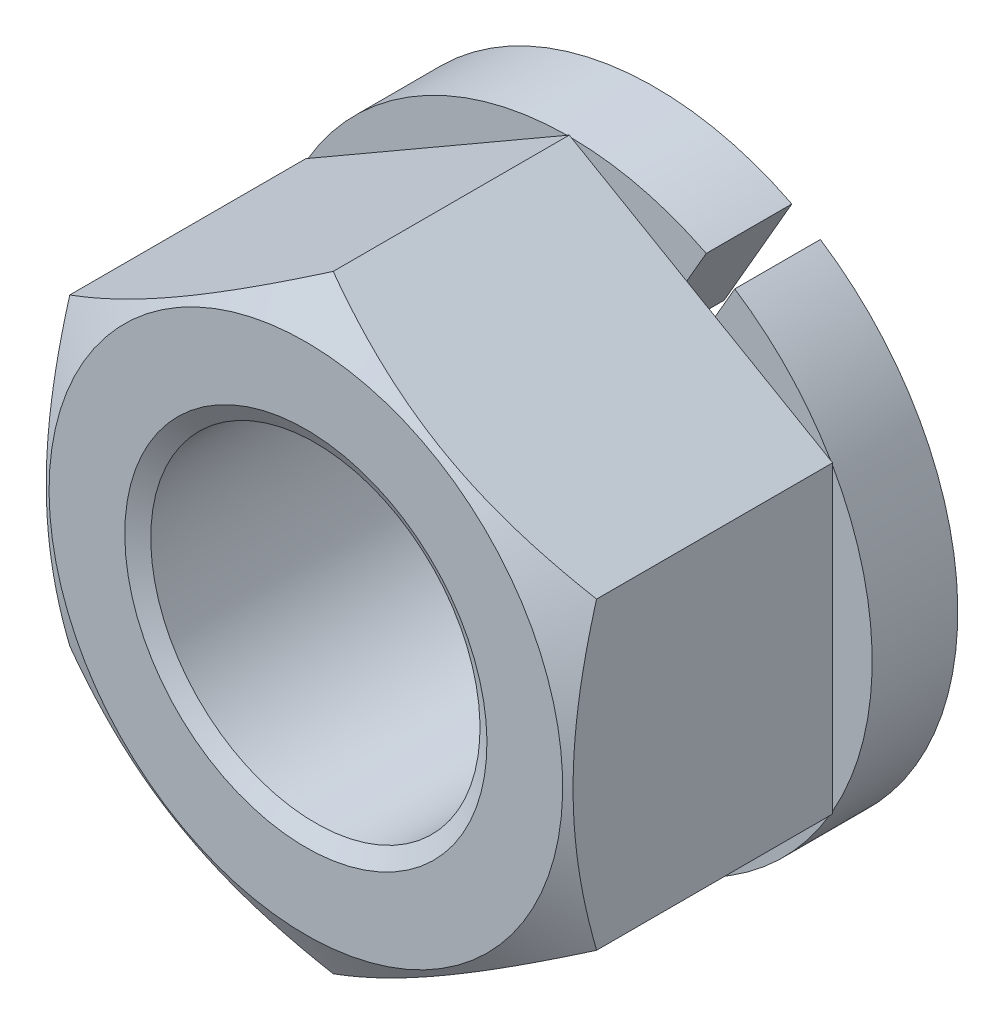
ISO-10303-21;
HEADER;
FILE_DESCRIPTION(('STEP AP214'),'2;1');
FILE_NAME('part.step','',(''),(''),'','','');
FILE_SCHEMA(('AUTOMOTIVE_DESIGN { 1 0 10303 214 1 1 1 1 }'));
ENDSEC;
DATA;
#1=APPLICATION_CONTEXT('core data for automotive mechanical design processes');
#2=APPLICATION_PROTOCOL_DEFINITION('international standard','automotive_design',2000,#1);
#3=PRODUCT_CONTEXT('',#1,'mechanical');
#4=PRODUCT('Part','Part','',(#3));
#5=PRODUCT_RELATED_PRODUCT_CATEGORY('part','',(#4));
#6=PRODUCT_DEFINITION_FORMATION('','',#4);
#7=PRODUCT_DEFINITION_CONTEXT('part definition',#1,'design');
#8=PRODUCT_DEFINITION('design','',#6,#7);
#9=PRODUCT_DEFINITION_SHAPE('','',#8);
#10=(LENGTH_UNIT() NAMED_UNIT(*) SI_UNIT(.MILLI.,.METRE.));
#11=(NAMED_UNIT(*) PLANE_ANGLE_UNIT() SI_UNIT($,.RADIAN.));
#12=(NAMED_UNIT(*) SI_UNIT($,.STERADIAN.) SOLID_ANGLE_UNIT());
#13=UNCERTAINTY_MEASURE_WITH_UNIT(LENGTH_MEASURE(1.E-05),#10,'distance_accuracy_value','');
#14=(GEOMETRIC_REPRESENTATION_CONTEXT(3) GLOBAL_UNCERTAINTY_ASSIGNED_CONTEXT((#13)) GLOBAL_UNIT_ASSIGNED_CONTEXT((#10,
#11,#12)) REPRESENTATION_CONTEXT('',''));
#15=CARTESIAN_POINT('',(0.,0.,0.));
#16=DIRECTION('',(0.,0.,1.));
#17=DIRECTION('',(1.,0.,0.));
#18=AXIS2_PLACEMENT_3D('',#15,#16,#17);
#19=CARTESIAN_POINT('',(8.,0.,1.3));
#20=DIRECTION('',(0.,0.,1.));
#21=DIRECTION('',(-0.866025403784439,0.5,0.));
#22=AXIS2_PLACEMENT_3D('',#19,#20,#21);
#23=PLANE('',#22);
#24=CARTESIAN_POINT('',(0.,0.,1.3));
#25=DIRECTION('',(0.,0.,-1.));
#26=DIRECTION('',(-0.866025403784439,0.5,0.));
#27=AXIS2_PLACEMENT_3D('',#24,#25,#26);
#28=CIRCLE('',#27,4.6);
#29=CARTESIAN_POINT('',(3.96723155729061,2.32831994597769,1.3));
#30=VERTEX_POINT('',#29);
#31=CARTESIAN_POINT('',(4.,2.2715633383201,1.3));
#32=VERTEX_POINT('',#31);
#33=EDGE_CURVE('E9',#30,#32,#28,.T.);
#34=ORIENTED_EDGE('',*,*,#33,.F.);
#35=DIRECTION('',(-0.866025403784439,0.5,0.));
#36=VECTOR('',#35,1.);
#37=CARTESIAN_POINT('',(4.,2.3094010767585,1.3));
#38=LINE('',#37,#36);
#39=CARTESIAN_POINT('',(4.,2.3094010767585,1.3));
#40=VERTEX_POINT('',#39);
#41=EDGE_CURVE('E344',#40,#30,#38,.T.);
#42=ORIENTED_EDGE('',*,*,#41,.F.);
#43=DIRECTION('',(0.,1.,0.));
#44=VECTOR('',#43,1.);
#45=CARTESIAN_POINT('',(4.,-2.30940107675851,1.3));
#46=LINE('',#45,#44);
#47=EDGE_CURVE('E339',#32,#40,#46,.T.);
#48=ORIENTED_EDGE('',*,*,#47,.F.);
#49=EDGE_LOOP('',(#34,#42,#48));
#50=FACE_BOUND('',#49,.T.);
#51=ADVANCED_FACE('F14',(#50),#23,.F.);
#52=CARTESIAN_POINT('',(4.,-2.27156333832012,1.3));
#53=VERTEX_POINT('',#52);
#54=CARTESIAN_POINT('',(3.9672315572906,-2.3283199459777,1.3));
#55=VERTEX_POINT('',#54);
#56=EDGE_CURVE('E24',#53,#55,#28,.T.);
#57=ORIENTED_EDGE('',*,*,#56,.F.);
#58=CARTESIAN_POINT('',(4.,-2.30940107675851,1.3));
#59=VERTEX_POINT('',#58);
#60=EDGE_CURVE('E341',#59,#53,#46,.T.);
#61=ORIENTED_EDGE('',*,*,#60,.F.);
#62=DIRECTION('',(0.866025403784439,0.5,0.));
#63=VECTOR('',#62,1.);
#64=CARTESIAN_POINT('',(0.,-4.61880215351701,1.3));
#65=LINE('',#64,#63);
#66=EDGE_CURVE('E333',#55,#59,#65,.T.);
#67=ORIENTED_EDGE('',*,*,#66,.F.);
#68=EDGE_LOOP('',(#57,#61,#67));
#69=FACE_BOUND('',#68,.T.);
#70=ADVANCED_FACE('F291',(#69),#23,.F.);
#71=CARTESIAN_POINT('',(0.0327684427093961,-4.59988328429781,1.3));
#72=VERTEX_POINT('',#71);
#73=CARTESIAN_POINT('',(-0.0327684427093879,-4.59988328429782,1.3));
#74=VERTEX_POINT('',#73);
#75=EDGE_CURVE('E434',#72,#74,#28,.T.);
#76=ORIENTED_EDGE('',*,*,#75,.F.);
#77=CARTESIAN_POINT('',(0.,-4.61880215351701,1.3));
#78=VERTEX_POINT('',#77);
#79=EDGE_CURVE('E336',#78,#72,#65,.T.);
#80=ORIENTED_EDGE('',*,*,#79,.F.);
#81=DIRECTION('',(0.866025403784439,-0.5,0.));
#82=VECTOR('',#81,1.);
#83=CARTESIAN_POINT('',(-4.,-2.30940107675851,1.3));
#84=LINE('',#83,#82);
#85=EDGE_CURVE('E357',#74,#78,#84,.T.);
#86=ORIENTED_EDGE('',*,*,#85,.F.);
#87=EDGE_LOOP('',(#76,#80,#86));
#88=FACE_BOUND('',#87,.T.);
#89=ADVANCED_FACE('F418',(#88),#23,.F.);
#90=CARTESIAN_POINT('',(-3.96723155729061,-2.32831994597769,1.3));
#91=VERTEX_POINT('',#90);
#92=CARTESIAN_POINT('',(-4.,-2.27156333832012,1.3));
#93=VERTEX_POINT('',#92);
#94=EDGE_CURVE('E438',#91,#93,#28,.T.);
#95=ORIENTED_EDGE('',*,*,#94,.F.);
#96=CARTESIAN_POINT('',(-4.,-2.30940107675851,1.3));
#97=VERTEX_POINT('',#96);
#98=EDGE_CURVE('E359',#97,#91,#84,.T.);
#99=ORIENTED_EDGE('',*,*,#98,.F.);
#100=DIRECTION('',(0.,-1.,0.));
#101=VECTOR('',#100,1.);
#102=CARTESIAN_POINT('',(-4.,2.3094010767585,1.3));
#103=LINE('',#102,#101);
#104=EDGE_CURVE('E352',#93,#97,#103,.T.);
#105=ORIENTED_EDGE('',*,*,#104,.F.);
#106=EDGE_LOOP('',(#95,#99,#105));
#107=FACE_BOUND('',#106,.T.);
#108=ADVANCED_FACE('F423',(#107),#23,.F.);
#109=CARTESIAN_POINT('',(-4.,2.27156333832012,1.3));
#110=VERTEX_POINT('',#109);
#111=CARTESIAN_POINT('',(-3.96723155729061,2.32831994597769,1.3));
#112=VERTEX_POINT('',#111);
#113=EDGE_CURVE('E450',#110,#112,#28,.T.);
#114=ORIENTED_EDGE('',*,*,#113,.F.);
#115=CARTESIAN_POINT('',(-4.,2.3094010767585,1.3));
#116=VERTEX_POINT('',#115);
#117=EDGE_CURVE('E354',#116,#110,#103,.T.);
#118=ORIENTED_EDGE('',*,*,#117,.F.);
#119=DIRECTION('',(-0.866025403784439,-0.5,0.));
#120=VECTOR('',#119,1.);
#121=CARTESIAN_POINT('',(0.,4.61880215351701,1.3));
#122=LINE('',#121,#120);
#123=EDGE_CURVE('E347',#112,#116,#122,.T.);
#124=ORIENTED_EDGE('',*,*,#123,.F.);
#125=EDGE_LOOP('',(#114,#118,#124));
#126=FACE_BOUND('',#125,.T.);
#127=ADVANCED_FACE('F429',(#126),#23,.F.);
#128=CARTESIAN_POINT('',(-0.0327684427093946,4.59988328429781,1.3));
#129=VERTEX_POINT('',#128);
#130=CARTESIAN_POINT('',(0.0327684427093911,4.59988328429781,1.3));
#131=VERTEX_POINT('',#130);
#132=EDGE_CURVE('E152',#129,#131,#28,.T.);
#133=ORIENTED_EDGE('',*,*,#132,.F.);
#134=CARTESIAN_POINT('',(0.,4.61880215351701,1.3));
#135=VERTEX_POINT('',#134);
#136=EDGE_CURVE('E349',#135,#129,#122,.T.);
#137=ORIENTED_EDGE('',*,*,#136,.F.);
#138=EDGE_CURVE('E343',#131,#135,#38,.T.);
#139=ORIENTED_EDGE('',*,*,#138,.F.);
#140=EDGE_LOOP('',(#133,#137,#139));
#141=FACE_BOUND('',#140,.T.);
#142=ADVANCED_FACE('F458',(#141),#23,.F.);
#143=DIRECTION('',(0.5,0.866025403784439,0.));
#144=VECTOR('',#143,1.);
#145=CARTESIAN_POINT('',(1.48536410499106,2.07272609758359,1.3));
#146=LINE('',#145,#144);
#147=CARTESIAN_POINT('',(1.58581274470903,2.24670824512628,1.3));
#148=VERTEX_POINT('',#147);
#149=CARTESIAN_POINT('',(2.21650635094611,3.33910161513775,1.3));
#150=VERTEX_POINT('',#149);
#151=EDGE_CURVE('E317',#148,#150,#146,.T.);
#152=ORIENTED_EDGE('',*,*,#151,.F.);
#153=CARTESIAN_POINT('',(0.,0.,1.3));
#154=DIRECTION('',(0.,0.,1.));
#155=DIRECTION('',(-0.866025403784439,0.5,0.));
#156=AXIS2_PLACEMENT_3D('',#153,#154,#155);
#157=CIRCLE('',#156,2.75);
#158=CARTESIAN_POINT('',(1.1528000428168,2.49670824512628,1.3));
#159=VERTEX_POINT('',#158);
#160=EDGE_CURVE('E328',#148,#159,#157,.T.);
#161=ORIENTED_EDGE('',*,*,#160,.T.);
#162=DIRECTION('',(-0.5,-0.866025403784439,0.));
#163=VECTOR('',#162,1.);
#164=CARTESIAN_POINT('',(1.05235140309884,2.32272609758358,1.3));
#165=LINE('',#164,#163);
#166=CARTESIAN_POINT('',(1.78349364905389,3.58910161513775,1.3));
#167=VERTEX_POINT('',#166);
#168=EDGE_CURVE('E168',#167,#159,#165,.T.);
#169=ORIENTED_EDGE('',*,*,#168,.F.);
#170=EDGE_CURVE('E483',#150,#167,#38,.T.);
#171=ORIENTED_EDGE('',*,*,#170,.F.);
#172=EDGE_LOOP('',(#152,#161,#169,#171));
#173=FACE_BOUND('',#172,.T.);
#174=ADVANCED_FACE('F255',(#173),#23,.F.);
#175=CARTESIAN_POINT('',(0.,-4.61880215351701,5.3));
#176=DIRECTION('',(-0.5,0.866025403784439,0.));
#177=DIRECTION('',(-0.866025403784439,-0.5,0.));
#178=AXIS2_PLACEMENT_3D('',#175,#176,#177);
#179=PLANE('',#178);
#180=CARTESIAN_POINT('',(-0.000199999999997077,-4.61891762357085,4.88493271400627));
#181=CARTESIAN_POINT('',(0.175579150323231,-4.51743148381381,4.94354709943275));
#182=CARTESIAN_POINT('',(0.352875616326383,-4.41506932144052,4.99685465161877));
#183=CARTESIAN_POINT('',(0.71053859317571,-4.2085725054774,5.08990330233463));
#184=CARTESIAN_POINT('',(0.890911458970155,-4.10443418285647,5.12961148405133));
#185=CARTESIAN_POINT('',(1.2494218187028,-3.89744813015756,5.19142275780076));
#186=CARTESIAN_POINT('',(1.42750415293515,-3.7946322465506,5.21393724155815));
#187=CARTESIAN_POINT('',(1.78450671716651,-3.58851671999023,5.24081434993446));
#188=CARTESIAN_POINT('',(1.9634256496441,-3.48521782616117,5.2451992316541));
#189=CARTESIAN_POINT('',(2.29774284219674,-3.29219970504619,5.23607490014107));
#190=CARTESIAN_POINT('',(2.45319115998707,-3.20245157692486,5.22480601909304));
#191=CARTESIAN_POINT('',(2.76307505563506,-3.02354002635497,5.18909098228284));
#192=CARTESIAN_POINT('',(2.91750956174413,-2.93437722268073,5.1646326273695));
#193=CARTESIAN_POINT('',(3.22803232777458,-2.75509682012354,5.10348890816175));
#194=CARTESIAN_POINT('',(3.38408128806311,-2.6650019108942,5.06654436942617));
#195=CARTESIAN_POINT('',(3.69385183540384,-2.48615580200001,4.98269490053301));
#196=CARTESIAN_POINT('',(3.84757739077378,-2.39740231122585,4.93580967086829));
#197=CARTESIAN_POINT('',(4.0002,-2.30928560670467,4.88493271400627));
#198=B_SPLINE_CURVE_WITH_KNOTS('',3,(#180,#181,#182,#183,#184,#185,#186,#187,#188,#189,#190,
#191,#192,#193,#194,#195,#196,#197),.UNSPECIFIED.,.F.,.F.,(4,2,2,2,2,2,2,2,4),(0.,
0.634047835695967,1.26961969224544,1.88946157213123,2.50854226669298,3.04757825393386,
3.58711366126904,4.13861653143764,4.68903648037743),.UNSPECIFIED.);
#199=CARTESIAN_POINT('',(5.80481843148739E-13,-4.61880215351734,4.88499938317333));
#200=VERTEX_POINT('',#199);
#201=CARTESIAN_POINT('',(4.,-2.30940107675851,4.88499938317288));
#202=VERTEX_POINT('',#201);
#203=EDGE_CURVE('E239',#200,#202,#198,.T.);
#204=ORIENTED_EDGE('',*,*,#203,.F.);
#205=DIRECTION('',(0.,0.,-1.));
#206=VECTOR('',#205,1.);
#207=CARTESIAN_POINT('',(0.,-4.61880215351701,5.3));
#208=LINE('',#207,#206);
#209=EDGE_CURVE('E362',#200,#78,#208,.T.);
#210=ORIENTED_EDGE('',*,*,#209,.T.);
#211=ORIENTED_EDGE('',*,*,#79,.T.);
#212=EDGE_CURVE('E340',#72,#55,#65,.T.);
#213=ORIENTED_EDGE('',*,*,#212,.T.);
#214=ORIENTED_EDGE('',*,*,#66,.T.);
#215=DIRECTION('',(0.,0.,-1.));
#216=VECTOR('',#215,1.);
#217=CARTESIAN_POINT('',(4.,-2.30940107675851,5.3));
#218=LINE('',#217,#216);
#219=EDGE_CURVE('E377',#202,#59,#218,.T.);
#220=ORIENTED_EDGE('',*,*,#219,.F.);
#221=EDGE_LOOP('',(#204,#210,#211,#213,#214,#220));
#222=FACE_BOUND('',#221,.T.);
#223=ADVANCED_FACE('F16',(#222),#179,.F.);
#224=CARTESIAN_POINT('',(4.,-2.30940107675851,5.3));
#225=DIRECTION('',(-1.,0.,0.));
#226=DIRECTION('',(0.,-1.,0.));
#227=AXIS2_PLACEMENT_3D('',#224,#225,#226);
#228=PLANE('',#227);
#229=CARTESIAN_POINT('',(4.,-2.30963201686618,4.88493271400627));
#230=CARTESIAN_POINT('',(4.,-2.1066597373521,4.94354709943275));
#231=CARTESIAN_POINT('',(4.,-1.90193541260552,4.99685465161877));
#232=CARTESIAN_POINT('',(4.,-1.48894178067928,5.08990330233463));
#233=CARTESIAN_POINT('',(4.,-1.28066513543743,5.12961148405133));
#234=CARTESIAN_POINT('',(4.,-0.866693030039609,5.19142275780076));
#235=CARTESIAN_POINT('',(4.,-0.661061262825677,5.21393724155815));
#236=CARTESIAN_POINT('',(4.,-0.248830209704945,5.24081434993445));
#237=CARTESIAN_POINT('',(4.,-0.0422324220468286,5.24519923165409));
#238=CARTESIAN_POINT('',(4.,0.343803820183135,5.23607490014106));
#239=CARTESIAN_POINT('',(4.,0.523300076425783,5.22480601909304));
#240=CARTESIAN_POINT('',(4.,0.881123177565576,5.18909098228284));
#241=CARTESIAN_POINT('',(4.,1.05944878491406,5.1646326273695));
#242=CARTESIAN_POINT('',(4.,1.41800959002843,5.10348890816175));
#243=CARTESIAN_POINT('',(4.,1.59819940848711,5.06654436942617));
#244=CARTESIAN_POINT('',(4.,1.95589162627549,4.98269490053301));
#245=CARTESIAN_POINT('',(4.,2.13339860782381,4.9358096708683));
#246=CARTESIAN_POINT('',(4.,2.30963201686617,4.88493271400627));
#247=B_SPLINE_CURVE_WITH_KNOTS('',3,(#229,#230,#231,#232,#233,#234,#235,#236,#237,#238,#239,
#240,#241,#242,#243,#244,#245,#246),.UNSPECIFIED.,.F.,.F.,(4,2,2,2,2,2,2,2,4),(0.,
0.634047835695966,1.26961969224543,1.88946157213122,2.50854226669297,3.04757825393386,
3.58711366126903,4.13861653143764,4.68903648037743),.UNSPECIFIED.);
#248=CARTESIAN_POINT('',(4.00000000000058,2.30940107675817,4.88499938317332));
#249=VERTEX_POINT('',#248);
#250=EDGE_CURVE('E233',#202,#249,#247,.T.);
#251=ORIENTED_EDGE('',*,*,#250,.F.);
#252=ORIENTED_EDGE('',*,*,#219,.T.);
#253=ORIENTED_EDGE('',*,*,#60,.T.);
#254=EDGE_CURVE('E33',#53,#32,#46,.T.);
#255=ORIENTED_EDGE('',*,*,#254,.T.);
#256=ORIENTED_EDGE('',*,*,#47,.T.);
#257=DIRECTION('',(0.,0.,-1.));
#258=VECTOR('',#257,1.);
#259=CARTESIAN_POINT('',(4.,2.3094010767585,5.3));
#260=LINE('',#259,#258);
#261=EDGE_CURVE('E375',#249,#40,#260,.T.);
#262=ORIENTED_EDGE('',*,*,#261,.F.);
#263=EDGE_LOOP('',(#251,#252,#253,#255,#256,#262));
#264=FACE_BOUND('',#263,.T.);
#265=ADVANCED_FACE('F245',(#264),#228,.F.);
#266=CARTESIAN_POINT('',(4.,2.3094010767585,5.3));
#267=DIRECTION('',(-0.5,-0.866025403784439,0.));
#268=DIRECTION('',(0.866025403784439,-0.5,0.));
#269=AXIS2_PLACEMENT_3D('',#266,#267,#268);
#270=PLANE('',#269);
#271=CARTESIAN_POINT('',(7.36789177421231,0.364947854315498,3.29259666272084));
#272=CARTESIAN_POINT('',(7.2165797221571,0.452307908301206,3.37733132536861));
#273=CARTESIAN_POINT('',(7.06491974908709,0.539868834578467,3.46125183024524));
#274=CARTESIAN_POINT('',(6.76071882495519,0.715499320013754,3.62700632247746));
#275=CARTESIAN_POINT('',(6.60817773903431,0.803568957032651,3.70883997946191));
#276=CARTESIAN_POINT('',(6.30124199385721,0.980778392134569,3.87037504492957));
#277=CARTESIAN_POINT('',(6.14684176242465,1.0699214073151,3.95006238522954));
#278=CARTESIAN_POINT('',(5.83681114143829,1.2489176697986,4.10616743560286));
#279=CARTESIAN_POINT('',(5.68118081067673,1.33877088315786,4.1825853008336));
#280=CARTESIAN_POINT('',(5.3635367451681,1.52216276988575,4.33362019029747));
#281=CARTESIAN_POINT('',(5.20147584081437,1.6157286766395,4.40810566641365));
#282=CARTESIAN_POINT('',(4.87545671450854,1.80395590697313,4.55142705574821));
#283=CARTESIAN_POINT('',(4.71149828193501,1.89861735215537,4.62026233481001));
#284=CARTESIAN_POINT('',(4.38173108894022,2.08900852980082,4.75047348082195));
#285=CARTESIAN_POINT('',(4.21592684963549,2.18473565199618,4.81186446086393));
#286=CARTESIAN_POINT('',(3.88194065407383,2.37756267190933,4.92521431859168));
#287=CARTESIAN_POINT('',(3.71375946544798,2.47466212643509,4.97717616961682));
#288=CARTESIAN_POINT('',(3.37580482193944,2.66978033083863,5.06891001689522));
#289=CARTESIAN_POINT('',(3.20604429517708,2.76779161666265,5.10874434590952));
#290=CARTESIAN_POINT('',(2.86441775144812,2.96502979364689,5.17394634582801));
#291=CARTESIAN_POINT('',(2.69255194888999,3.06425656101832,5.19931547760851));
#292=CARTESIAN_POINT('',(2.34981616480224,3.2621351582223,5.23323151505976));
#293=CARTESIAN_POINT('',(2.17896261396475,3.36077750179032,5.24199435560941));
#294=CARTESIAN_POINT('',(1.83721915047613,3.55808318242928,5.24252299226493));
#295=CARTESIAN_POINT('',(1.66632923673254,3.65674652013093,5.23428817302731));
#296=CARTESIAN_POINT('',(1.376161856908,3.82427473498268,5.206455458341));
#297=CARTESIAN_POINT('',(1.25657295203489,3.89331942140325,5.19094029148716));
#298=CARTESIAN_POINT('',(1.01827795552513,4.03089910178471,5.15255337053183));
#299=CARTESIAN_POINT('',(0.89957198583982,4.09943402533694,5.12968061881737));
#300=CARTESIAN_POINT('',(0.544939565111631,4.30418114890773,5.05122936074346));
#301=CARTESIAN_POINT('',(0.310624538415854,4.43946299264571,4.98583152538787));
#302=CARTESIAN_POINT('',(-0.039897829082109,4.64183717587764,4.87249475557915));
#303=CARTESIAN_POINT('',(-0.15792090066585,4.7099778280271,4.83161840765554));
#304=CARTESIAN_POINT('',(-0.392819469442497,4.84559657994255,4.74564464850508));
#305=CARTESIAN_POINT('',(-0.509694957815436,4.91307467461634,4.70054720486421));
#306=CARTESIAN_POINT('',(-0.74233836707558,5.04739140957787,4.60685321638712));
#307=CARTESIAN_POINT('',(-0.858106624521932,5.11423024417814,4.55825777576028));
#308=CARTESIAN_POINT('',(-1.08868288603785,5.2473535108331,4.45813729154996));
#309=CARTESIAN_POINT('',(-1.20349091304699,5.31363795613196,4.40661231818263));
#310=CARTESIAN_POINT('',(-1.51946769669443,5.49606723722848,4.26091200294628));
#311=CARTESIAN_POINT('',(-1.71974743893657,5.6116988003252,4.16416822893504));
#312=CARTESIAN_POINT('',(-2.11823117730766,5.84176349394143,3.96511964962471));
#313=CARTESIAN_POINT('',(-2.31643493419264,5.95619648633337,3.86281421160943));
#314=CARTESIAN_POINT('',(-2.71125542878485,6.18414620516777,3.65400373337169));
#315=CARTESIAN_POINT('',(-2.90787158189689,6.29766259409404,3.54749722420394));
#316=CARTESIAN_POINT('',(-3.29979247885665,6.52393822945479,3.3313077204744));
#317=CARTESIAN_POINT('',(-3.49509718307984,6.63669745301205,3.22162463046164));
#318=CARTESIAN_POINT('',(-3.88495810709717,6.86178376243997,2.9996241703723));
#319=CARTESIAN_POINT('',(-4.07951267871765,6.97410989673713,2.88730294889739));
#320=CARTESIAN_POINT('',(-4.46776896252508,7.19826976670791,2.66071005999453));
#321=CARTESIAN_POINT('',(-4.66147066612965,7.3101034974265,2.54643837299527));
#322=CARTESIAN_POINT('',(-5.24145333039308,7.6449566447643,2.20135857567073));
#323=CARTESIAN_POINT('',(-5.62670044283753,7.86737916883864,1.96823479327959));
#324=CARTESIAN_POINT('',(-6.35346211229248,8.28697521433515,1.52350784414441));
#325=CARTESIAN_POINT('',(-6.69517072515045,8.48426077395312,1.31232552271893));
#326=CARTESIAN_POINT('',(-7.37750291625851,8.8782054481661,0.887578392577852));
#327=CARTESIAN_POINT('',(-7.71812642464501,9.07486452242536,0.674013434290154));
#328=CARTESIAN_POINT('',(-8.39742822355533,9.46705959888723,0.245830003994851));
#329=CARTESIAN_POINT('',(-8.73610923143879,9.66259716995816,0.0312172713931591));
#330=CARTESIAN_POINT('',(-9.41279636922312,10.0532826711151,-0.399350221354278));
#331=CARTESIAN_POINT('',(-9.75080255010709,10.2484306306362,-0.615304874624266));
#332=CARTESIAN_POINT('',(-10.0885733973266,10.4434427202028,-0.831746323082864));
#333=B_SPLINE_CURVE_WITH_KNOTS('',3,(#271,#272,#273,#274,#275,#276,#277,#278,#279,#280,#281,
#282,#283,#284,#285,#286,#287,#288,#289,#290,#291,#292,#293,#294,#295,#296,#297,#298,#299,#300,
#301,#302,#303,#304,#305,#306,#307,#308,#309,#310,#311,#312,#313,#314,#315,#316,#317,#318,#319,
#320,#321,#322,#323,#324,#325,#326,#327,#328,#329,#330,#331,#332),.UNSPECIFIED.,.F.,.F.,(4,2,2,
2,2,2,2,2,2,2,2,2,2,2,2,2,2,2,2,2,2,2,2,2,2,2,2,2,2,2,4),(0.,0.582556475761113,1.16520461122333,
1.75103140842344,2.33683037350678,2.94099294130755,3.54522322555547,4.14820552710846,
4.75099735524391,5.35063652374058,5.95021512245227,6.5419423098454,7.13369091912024,
7.55036371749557,7.9670930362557,8.8009878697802,9.22779049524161,9.65459639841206,
10.081268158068,10.5079296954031,11.259867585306,12.0118911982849,12.7641801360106,
13.5164917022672,14.2699797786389,15.0234754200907,16.5301238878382,17.8727098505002,
19.2153805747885,20.553654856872,21.891823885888),.UNSPECIFIED.);
#334=CARTESIAN_POINT('',(0.,4.61880215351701,4.88499938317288));
#335=VERTEX_POINT('',#334);
#336=EDGE_CURVE('E227',#249,#335,#333,.T.);
#337=ORIENTED_EDGE('',*,*,#336,.F.);
#338=ORIENTED_EDGE('',*,*,#261,.T.);
#339=ORIENTED_EDGE('',*,*,#41,.T.);
#340=EDGE_CURVE('E348',#30,#150,#38,.T.);
#341=ORIENTED_EDGE('',*,*,#340,.T.);
#342=ORIENTED_EDGE('',*,*,#170,.T.);
#343=EDGE_CURVE('E161',#167,#131,#38,.T.);
#344=ORIENTED_EDGE('',*,*,#343,.T.);
#345=ORIENTED_EDGE('',*,*,#138,.T.);
#346=DIRECTION('',(0.,0.,-1.));
#347=VECTOR('',#346,1.);
#348=CARTESIAN_POINT('',(0.,4.61880215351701,5.3));
#349=LINE('',#348,#347);
#350=EDGE_CURVE('E372',#335,#135,#349,.T.);
#351=ORIENTED_EDGE('',*,*,#350,.F.);
#352=EDGE_LOOP('',(#337,#338,#339,#341,#342,#344,#345,#351));
#353=FACE_BOUND('',#352,.T.);
#354=ADVANCED_FACE('F218',(#353),#270,.F.);
#355=CARTESIAN_POINT('',(0.,4.61880215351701,5.3));
#356=DIRECTION('',(0.5,-0.866025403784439,0.));
#357=DIRECTION('',(0.866025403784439,0.5,0.));
#358=AXIS2_PLACEMENT_3D('',#355,#356,#357);
#359=PLANE('',#358);
#360=CARTESIAN_POINT('',(0.00020000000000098,4.61891762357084,4.88493271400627));
#361=CARTESIAN_POINT('',(-0.17557915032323,4.5174314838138,4.94354709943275));
#362=CARTESIAN_POINT('',(-0.352875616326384,4.41506932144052,4.99685465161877));
#363=CARTESIAN_POINT('',(-0.710538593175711,4.20857250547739,5.08990330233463));
#364=CARTESIAN_POINT('',(-0.890911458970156,4.10443418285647,5.12961148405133));
#365=CARTESIAN_POINT('',(-1.2494218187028,3.89744813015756,5.19142275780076));
#366=CARTESIAN_POINT('',(-1.42750415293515,3.79463224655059,5.21393724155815));
#367=CARTESIAN_POINT('',(-1.78450671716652,3.58851671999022,5.24081434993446));
#368=CARTESIAN_POINT('',(-1.9634256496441,3.48521782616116,5.2451992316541));
#369=CARTESIAN_POINT('',(-2.29774284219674,3.29219970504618,5.23607490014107));
#370=CARTESIAN_POINT('',(-2.45319115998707,3.20245157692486,5.22480601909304));
#371=CARTESIAN_POINT('',(-2.76307505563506,3.02354002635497,5.18909098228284));
#372=CARTESIAN_POINT('',(-2.91750956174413,2.93437722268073,5.1646326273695));
#373=CARTESIAN_POINT('',(-3.22803232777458,2.75509682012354,5.10348890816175));
#374=CARTESIAN_POINT('',(-3.38408128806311,2.6650019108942,5.06654436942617));
#375=CARTESIAN_POINT('',(-3.69385183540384,2.48615580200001,4.98269490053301));
#376=CARTESIAN_POINT('',(-3.84757739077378,2.39740231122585,4.9358096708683));
#377=CARTESIAN_POINT('',(-4.0002,2.30928560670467,4.88493271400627));
#378=B_SPLINE_CURVE_WITH_KNOTS('',3,(#360,#361,#362,#363,#364,#365,#366,#367,#368,#369,#370,
#371,#372,#373,#374,#375,#376,#377),.UNSPECIFIED.,.F.,.F.,(4,2,2,2,2,2,2,2,4),(0.,
0.634047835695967,1.26961969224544,1.88946157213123,2.50854226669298,3.04757825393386,
3.58711366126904,4.13861653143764,4.68903648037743),.UNSPECIFIED.);
#379=CARTESIAN_POINT('',(-4.,2.3094010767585,4.88499938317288));
#380=VERTEX_POINT('',#379);
#381=EDGE_CURVE('E221',#335,#380,#378,.T.);
#382=ORIENTED_EDGE('',*,*,#381,.F.);
#383=ORIENTED_EDGE('',*,*,#350,.T.);
#384=ORIENTED_EDGE('',*,*,#136,.T.);
#385=EDGE_CURVE('E353',#129,#112,#122,.T.);
#386=ORIENTED_EDGE('',*,*,#385,.T.);
#387=ORIENTED_EDGE('',*,*,#123,.T.);
#388=DIRECTION('',(0.,0.,-1.));
#389=VECTOR('',#388,1.);
#390=CARTESIAN_POINT('',(-4.,2.3094010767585,5.3));
#391=LINE('',#390,#389);
#392=EDGE_CURVE('E369',#380,#116,#391,.T.);
#393=ORIENTED_EDGE('',*,*,#392,.F.);
#394=EDGE_LOOP('',(#382,#383,#384,#386,#387,#393));
#395=FACE_BOUND('',#394,.T.);
#396=ADVANCED_FACE('F213',(#395),#359,.F.);
#397=CARTESIAN_POINT('',(-4.,2.3094010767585,5.3));
#398=DIRECTION('',(1.,0.,0.));
#399=DIRECTION('',(0.,1.,0.));
#400=AXIS2_PLACEMENT_3D('',#397,#398,#399);
#401=PLANE('',#400);
#402=CARTESIAN_POINT('',(-4.,2.30963201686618,4.88493271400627));
#403=CARTESIAN_POINT('',(-4.,2.1066597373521,4.94354709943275));
#404=CARTESIAN_POINT('',(-4.,1.90193541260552,4.99685465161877));
#405=CARTESIAN_POINT('',(-4.,1.48894178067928,5.08990330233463));
#406=CARTESIAN_POINT('',(-4.,1.28066513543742,5.12961148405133));
#407=CARTESIAN_POINT('',(-4.,0.866693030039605,5.19142275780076));
#408=CARTESIAN_POINT('',(-4.,0.661061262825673,5.21393724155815));
#409=CARTESIAN_POINT('',(-4.,0.24883020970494,5.24081434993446));
#410=CARTESIAN_POINT('',(-4.,0.0422324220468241,5.2451992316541));
#411=CARTESIAN_POINT('',(-4.,-0.343803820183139,5.23607490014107));
#412=CARTESIAN_POINT('',(-4.,-0.523300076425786,5.22480601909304));
#413=CARTESIAN_POINT('',(-4.,-0.881123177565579,5.18909098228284));
#414=CARTESIAN_POINT('',(-4.,-1.05944878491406,5.1646326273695));
#415=CARTESIAN_POINT('',(-4.,-1.41800959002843,5.10348890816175));
#416=CARTESIAN_POINT('',(-4.,-1.59819940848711,5.06654436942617));
#417=CARTESIAN_POINT('',(-4.,-1.9558916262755,4.98269490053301));
#418=CARTESIAN_POINT('',(-4.,-2.13339860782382,4.9358096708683));
#419=CARTESIAN_POINT('',(-4.,-2.30963201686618,4.88493271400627));
#420=B_SPLINE_CURVE_WITH_KNOTS('',3,(#402,#403,#404,#405,#406,#407,#408,#409,#410,#411,#412,
#413,#414,#415,#416,#417,#418,#419),.UNSPECIFIED.,.F.,.F.,(4,2,2,2,2,2,2,2,4),(0.,
0.634047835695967,1.26961969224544,1.88946157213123,2.50854226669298,3.04757825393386,
3.58711366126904,4.13861653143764,4.68903648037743),.UNSPECIFIED.);
#421=CARTESIAN_POINT('',(-4.,-2.30940107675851,4.88499938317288));
#422=VERTEX_POINT('',#421);
#423=EDGE_CURVE('E191',#380,#422,#420,.T.);
#424=ORIENTED_EDGE('',*,*,#423,.F.);
#425=ORIENTED_EDGE('',*,*,#392,.T.);
#426=ORIENTED_EDGE('',*,*,#117,.T.);
#427=EDGE_CURVE('E358',#110,#93,#103,.T.);
#428=ORIENTED_EDGE('',*,*,#427,.T.);
#429=ORIENTED_EDGE('',*,*,#104,.T.);
#430=DIRECTION('',(0.,0.,-1.));
#431=VECTOR('',#430,1.);
#432=CARTESIAN_POINT('',(-4.,-2.30940107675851,5.3));
#433=LINE('',#432,#431);
#434=EDGE_CURVE('E366',#422,#97,#433,.T.);
#435=ORIENTED_EDGE('',*,*,#434,.F.);
#436=EDGE_LOOP('',(#424,#425,#426,#428,#429,#435));
#437=FACE_BOUND('',#436,.T.);
#438=ADVANCED_FACE('F207',(#437),#401,.F.);
#439=CARTESIAN_POINT('',(-4.,-2.30940107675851,5.3));
#440=DIRECTION('',(0.5,0.866025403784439,0.));
#441=DIRECTION('',(-0.866025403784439,0.5,0.));
#442=AXIS2_PLACEMENT_3D('',#439,#440,#441);
#443=PLANE('',#442);
#444=CARTESIAN_POINT('',(3.3678917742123,-6.56325537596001,3.29259666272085));
#445=CARTESIAN_POINT('',(3.21657972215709,-6.4758953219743,3.37733132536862));
#446=CARTESIAN_POINT('',(3.06491974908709,-6.38833439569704,3.46125183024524));
#447=CARTESIAN_POINT('',(2.76071882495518,-6.21270391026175,3.62700632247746));
#448=CARTESIAN_POINT('',(2.60817773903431,-6.12463427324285,3.70883997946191));
#449=CARTESIAN_POINT('',(2.3012419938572,-5.94742483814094,3.87037504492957));
#450=CARTESIAN_POINT('',(2.14684176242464,-5.8582818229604,3.95006238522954));
#451=CARTESIAN_POINT('',(1.83681114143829,-5.67928556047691,4.10616743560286));
#452=CARTESIAN_POINT('',(1.68118081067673,-5.58943234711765,4.1825853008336));
#453=CARTESIAN_POINT('',(1.36353674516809,-5.40604046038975,4.33362019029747));
#454=CARTESIAN_POINT('',(1.20147584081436,-5.31247455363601,4.40810566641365));
#455=CARTESIAN_POINT('',(0.875456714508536,-5.12424732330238,4.55142705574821));
#456=CARTESIAN_POINT('',(0.711498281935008,-5.02958587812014,4.62026233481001));
#457=CARTESIAN_POINT('',(0.381731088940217,-4.83919470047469,4.75047348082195));
#458=CARTESIAN_POINT('',(0.215926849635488,-4.74346757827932,4.81186446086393));
#459=CARTESIAN_POINT('',(-0.118059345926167,-4.55064055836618,4.92521431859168));
#460=CARTESIAN_POINT('',(-0.28624053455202,-4.45354110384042,4.97717616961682));
#461=CARTESIAN_POINT('',(-0.624195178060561,-4.25842289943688,5.06891001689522));
#462=CARTESIAN_POINT('',(-0.793955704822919,-4.16041161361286,5.10874434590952));
#463=CARTESIAN_POINT('',(-1.13558224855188,-3.96317343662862,5.17394634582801));
#464=CARTESIAN_POINT('',(-1.30744805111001,-3.86394666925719,5.19931547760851));
#465=CARTESIAN_POINT('',(-1.65018383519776,-3.66606807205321,5.23323151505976));
#466=CARTESIAN_POINT('',(-1.82103738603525,-3.56742572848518,5.24199435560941));
#467=CARTESIAN_POINT('',(-2.16278084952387,-3.37012004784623,5.24252299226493));
#468=CARTESIAN_POINT('',(-2.33367076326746,-3.27145671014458,5.23428817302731));
#469=CARTESIAN_POINT('',(-2.623838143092,-3.10392849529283,5.206455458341));
#470=CARTESIAN_POINT('',(-2.7434270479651,-3.03488380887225,5.19094029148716));
#471=CARTESIAN_POINT('',(-2.98172204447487,-2.8973041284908,5.15255337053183));
#472=CARTESIAN_POINT('',(-3.10042801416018,-2.82876920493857,5.12968061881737));
#473=CARTESIAN_POINT('',(-3.45506043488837,-2.62402208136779,5.05122936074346));
#474=CARTESIAN_POINT('',(-3.68937546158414,-2.4887402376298,4.98583152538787));
#475=CARTESIAN_POINT('',(-4.0398978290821,-2.28636605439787,4.87249475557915));
#476=CARTESIAN_POINT('',(-4.15792090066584,-2.21822540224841,4.83161840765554));
#477=CARTESIAN_POINT('',(-4.39281946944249,-2.08260665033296,4.74564464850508));
#478=CARTESIAN_POINT('',(-4.50969495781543,-2.01512855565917,4.70054720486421));
#479=CARTESIAN_POINT('',(-4.74233836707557,-1.88081182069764,4.60685321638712));
#480=CARTESIAN_POINT('',(-4.85810662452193,-1.81397298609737,4.55825777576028));
#481=CARTESIAN_POINT('',(-5.08868288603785,-1.68084971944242,4.45813729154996));
#482=CARTESIAN_POINT('',(-5.20349091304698,-1.61456527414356,4.40661231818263));
#483=CARTESIAN_POINT('',(-5.51946769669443,-1.43213599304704,4.26091200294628));
#484=CARTESIAN_POINT('',(-5.71974743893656,-1.31650442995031,4.16416822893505));
#485=CARTESIAN_POINT('',(-6.11823117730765,-1.08643973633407,3.96511964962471));
#486=CARTESIAN_POINT('',(-6.31643493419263,-0.972006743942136,3.86281421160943));
#487=CARTESIAN_POINT('',(-6.71125542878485,-0.74405702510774,3.65400373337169));
#488=CARTESIAN_POINT('',(-6.90787158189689,-0.630540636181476,3.54749722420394));
#489=CARTESIAN_POINT('',(-7.29979247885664,-0.404265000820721,3.3313077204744));
#490=CARTESIAN_POINT('',(-7.49509718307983,-0.291505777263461,3.22162463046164));
#491=CARTESIAN_POINT('',(-7.88495810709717,-0.0664194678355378,2.9996241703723));
#492=CARTESIAN_POINT('',(-8.07951267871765,0.0459066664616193,2.88730294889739));
#493=CARTESIAN_POINT('',(-8.46776896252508,0.270066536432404,2.66071005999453));
#494=CARTESIAN_POINT('',(-8.66147066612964,0.381900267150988,2.54643837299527));
#495=CARTESIAN_POINT('',(-9.24145333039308,0.716753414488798,2.20135857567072));
#496=CARTESIAN_POINT('',(-9.62670044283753,0.939175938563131,1.96823479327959));
#497=CARTESIAN_POINT('',(-10.3534621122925,1.35877198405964,1.52350784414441));
#498=CARTESIAN_POINT('',(-10.6951707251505,1.55605754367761,1.31232552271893));
#499=CARTESIAN_POINT('',(-11.3775029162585,1.95000221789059,0.887578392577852));
#500=CARTESIAN_POINT('',(-11.718126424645,2.14666129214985,0.674013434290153));
#501=CARTESIAN_POINT('',(-12.3974282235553,2.53885636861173,0.245830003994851));
#502=CARTESIAN_POINT('',(-12.7361092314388,2.73439393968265,0.0312172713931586));
#503=CARTESIAN_POINT('',(-13.4127963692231,3.12507944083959,-0.399350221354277));
#504=CARTESIAN_POINT('',(-13.7508025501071,3.32022740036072,-0.615304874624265));
#505=CARTESIAN_POINT('',(-14.0885733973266,3.51523948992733,-0.831746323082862));
#506=B_SPLINE_CURVE_WITH_KNOTS('',3,(#444,#445,#446,#447,#448,#449,#450,#451,#452,#453,#454,
#455,#456,#457,#458,#459,#460,#461,#462,#463,#464,#465,#466,#467,#468,#469,#470,#471,#472,#473,
#474,#475,#476,#477,#478,#479,#480,#481,#482,#483,#484,#485,#486,#487,#488,#489,#490,#491,#492,
#493,#494,#495,#496,#497,#498,#499,#500,#501,#502,#503,#504,#505),.UNSPECIFIED.,.F.,.F.,(4,2,2,
2,2,2,2,2,2,2,2,2,2,2,2,2,2,2,2,2,2,2,2,2,2,2,2,2,2,2,4),(0.,0.582556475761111,1.16520461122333,
1.75103140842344,2.33683037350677,2.94099294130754,3.54522322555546,4.14820552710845,
4.75099735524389,5.35063652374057,5.95021512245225,6.54194230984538,7.13369091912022,
7.55036371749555,7.96709303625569,8.80098786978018,9.22779049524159,9.65459639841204,
10.081268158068,10.5079296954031,11.259867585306,12.0118911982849,12.7641801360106,
13.5164917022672,14.2699797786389,15.0234754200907,16.5301238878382,17.8727098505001,
19.2153805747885,20.553654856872,21.891823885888),.UNSPECIFIED.);
#507=EDGE_CURVE('E177',#422,#200,#506,.F.);
#508=ORIENTED_EDGE('',*,*,#507,.F.);
#509=ORIENTED_EDGE('',*,*,#434,.T.);
#510=ORIENTED_EDGE('',*,*,#98,.T.);
#511=EDGE_CURVE('E363',#91,#74,#84,.T.);
#512=ORIENTED_EDGE('',*,*,#511,.T.);
#513=ORIENTED_EDGE('',*,*,#85,.T.);
#514=ORIENTED_EDGE('',*,*,#209,.F.);
#515=EDGE_LOOP('',(#508,#509,#510,#512,#513,#514));
#516=FACE_BOUND('',#515,.T.);
#517=ADVANCED_FACE('F202',(#516),#443,.F.);
#518=CARTESIAN_POINT('',(8.,0.,5.3));
#519=DIRECTION('',(0.,0.,1.));
#520=DIRECTION('',(-0.866025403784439,0.5,0.));
#521=AXIS2_PLACEMENT_3D('',#518,#519,#520);
#522=PLANE('',#521);
#523=CARTESIAN_POINT('',(0.,0.,5.3));
#524=DIRECTION('',(0.,0.,1.));
#525=DIRECTION('',(-0.866025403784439,0.5,0.));
#526=AXIS2_PLACEMENT_3D('',#523,#524,#525);
#527=CIRCLE('',#526,2.75);
#528=CARTESIAN_POINT('',(-2.38156986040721,1.375,5.3));
#529=VERTEX_POINT('',#528);
#530=EDGE_CURVE('E331',#529,#529,#527,.T.);
#531=ORIENTED_EDGE('',*,*,#530,.F.);
#532=EDGE_LOOP('',(#531));
#533=FACE_BOUND('',#532,.T.);
#534=CARTESIAN_POINT('',(0.,0.,5.3));
#535=DIRECTION('',(0.,0.,1.));
#536=DIRECTION('',(-0.866025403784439,0.5,0.));
#537=AXIS2_PLACEMENT_3D('',#534,#535,#536);
#538=CIRCLE('',#537,3.9);
#539=CARTESIAN_POINT('',(-3.37749907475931,1.95,5.3));
#540=VERTEX_POINT('',#539);
#541=EDGE_CURVE('E173',#540,#540,#538,.T.);
#542=ORIENTED_EDGE('',*,*,#541,.T.);
#543=EDGE_LOOP('',(#542));
#544=FACE_BOUND('',#543,.T.);
#545=ADVANCED_FACE('F206',(#533,#544),#522,.T.);
#546=CARTESIAN_POINT('',(0.,0.,5.3));
#547=DIRECTION('',(0.,0.,1.));
#548=DIRECTION('',(-0.866025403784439,0.5,0.));
#549=AXIS2_PLACEMENT_3D('',#546,#547,#548);
#550=CONICAL_SURFACE('',#549,2.75,1.0471975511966);
#551=CARTESIAN_POINT('',(0.,0.,5.15566243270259));
#552=DIRECTION('',(0.,0.,1.));
#553=DIRECTION('',(0.866025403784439,-0.5,0.));
#554=AXIS2_PLACEMENT_3D('',#551,#552,#553);
#555=CIRCLE('',#554,2.5);
#556=CARTESIAN_POINT('',(2.1650635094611,-1.25,5.15566243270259));
#557=VERTEX_POINT('',#556);
#558=EDGE_CURVE('E157',#557,#557,#555,.F.);
#559=ORIENTED_EDGE('',*,*,#558,.T.);
#560=EDGE_LOOP('',(#559));
#561=FACE_BOUND('',#560,.T.);
#562=ORIENTED_EDGE('',*,*,#530,.T.);
#563=EDGE_LOOP('',(#562));
#564=FACE_BOUND('',#563,.T.);
#565=ADVANCED_FACE('F396',(#561,#564),#550,.F.);
#566=CARTESIAN_POINT('',(0.,0.,1.67527767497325));
#567=DIRECTION('',(0.,0.,-1.));
#568=DIRECTION('',(0.866025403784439,-0.5,0.));
#569=AXIS2_PLACEMENT_3D('',#566,#567,#568);
#570=CONICAL_SURFACE('',#569,2.1,1.0471975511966);
#571=CARTESIAN_POINT('',(0.,0.,1.4443375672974));
#572=DIRECTION('',(0.,0.,-1.));
#573=DIRECTION('',(-0.866025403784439,0.5,0.));
#574=AXIS2_PLACEMENT_3D('',#571,#572,#573);
#575=CIRCLE('',#574,2.5);
#576=CARTESIAN_POINT('',(-2.1650635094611,1.25,1.4443375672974));
#577=VERTEX_POINT('',#576);
#578=EDGE_CURVE('E19',#577,#577,#575,.F.);
#579=ORIENTED_EDGE('',*,*,#578,.T.);
#580=EDGE_LOOP('',(#579));
#581=FACE_BOUND('',#580,.T.);
#582=ORIENTED_EDGE('',*,*,#160,.F.);
#583=EDGE_CURVE('E329',#159,#148,#157,.T.);
#584=ORIENTED_EDGE('',*,*,#583,.F.);
#585=EDGE_LOOP('',(#582,#584));
#586=FACE_BOUND('',#585,.T.);
#587=ADVANCED_FACE('F302',(#581,#586),#570,.F.);
#588=CARTESIAN_POINT('',(0.,0.,5.3));
#589=DIRECTION('',(0.,0.,-1.));
#590=DIRECTION('',(0.866025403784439,-0.5,0.));
#591=AXIS2_PLACEMENT_3D('',#588,#589,#590);
#592=CONICAL_SURFACE('',#591,3.9,1.0471975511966);
#593=ORIENTED_EDGE('',*,*,#541,.F.);
#594=EDGE_LOOP('',(#593));
#595=FACE_BOUND('',#594,.T.);
#596=ORIENTED_EDGE('',*,*,#203,.T.);
#597=ORIENTED_EDGE('',*,*,#250,.T.);
#598=ORIENTED_EDGE('',*,*,#336,.T.);
#599=ORIENTED_EDGE('',*,*,#381,.T.);
#600=ORIENTED_EDGE('',*,*,#423,.T.);
#601=ORIENTED_EDGE('',*,*,#507,.T.);
#602=EDGE_LOOP('',(#596,#597,#598,#599,#600,#601));
#603=FACE_BOUND('',#602,.T.);
#604=ADVANCED_FACE('F198',(#595,#603),#592,.T.);
#605=CARTESIAN_POINT('',(0.,0.,0.));
#606=DIRECTION('',(0.,0.,-1.));
#607=DIRECTION('',(-0.866025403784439,0.5,0.));
#608=AXIS2_PLACEMENT_3D('',#605,#606,#607);
#609=PLANE('',#608);
#610=CARTESIAN_POINT('',(0.,0.,0.));
#611=DIRECTION('',(0.,0.,-1.));
#612=DIRECTION('',(-0.866025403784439,0.5,0.));
#613=AXIS2_PLACEMENT_3D('',#610,#611,#612);
#614=CIRCLE('',#613,4.6);
#615=CARTESIAN_POINT('',(2.51310709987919,3.85282918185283,0.));
#616=VERTEX_POINT('',#615);
#617=CARTESIAN_POINT('',(2.08009439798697,4.10282918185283,0.));
#618=VERTEX_POINT('',#617);
#619=EDGE_CURVE('E323',#616,#618,#614,.T.);
#620=ORIENTED_EDGE('',*,*,#619,.T.);
#621=DIRECTION('',(-0.5,-0.866025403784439,0.));
#622=VECTOR('',#621,1.);
#623=CARTESIAN_POINT('',(1.05235140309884,2.32272609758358,0.));
#624=LINE('',#623,#622);
#625=CARTESIAN_POINT('',(1.05235140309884,2.32272609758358,0.));
#626=VERTEX_POINT('',#625);
#627=EDGE_CURVE('E171',#618,#626,#624,.T.);
#628=ORIENTED_EDGE('',*,*,#627,.T.);
#629=CARTESIAN_POINT('',(0.,0.,0.));
#630=DIRECTION('',(0.,0.,1.));
#631=DIRECTION('',(-0.866025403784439,0.5,0.));
#632=AXIS2_PLACEMENT_3D('',#629,#630,#631);
#633=CIRCLE('',#632,2.55);
#634=CARTESIAN_POINT('',(1.48536410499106,2.07272609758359,0.));
#635=VERTEX_POINT('',#634);
#636=EDGE_CURVE('E490',#626,#635,#633,.T.);
#637=ORIENTED_EDGE('',*,*,#636,.T.);
#638=DIRECTION('',(0.5,0.866025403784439,0.));
#639=VECTOR('',#638,1.);
#640=CARTESIAN_POINT('',(1.48536410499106,2.07272609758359,0.));
#641=LINE('',#640,#639);
#642=EDGE_CURVE('E492',#635,#616,#641,.T.);
#643=ORIENTED_EDGE('',*,*,#642,.T.);
#644=EDGE_LOOP('',(#620,#628,#637,#643));
#645=FACE_BOUND('',#644,.T.);
#646=ADVANCED_FACE('F279',(#645),#609,.T.);
#647=CARTESIAN_POINT('',(0.,0.,0.));
#648=DIRECTION('',(0.,0.,1.));
#649=DIRECTION('',(0.866025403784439,-0.5,0.));
#650=AXIS2_PLACEMENT_3D('',#647,#648,#649);
#651=CYLINDRICAL_SURFACE('',#650,2.55);
#652=CARTESIAN_POINT('',(0.,0.,1.3));
#653=DIRECTION('',(0.,0.,1.));
#654=DIRECTION('',(-0.866025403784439,0.5,0.));
#655=AXIS2_PLACEMENT_3D('',#652,#653,#654);
#656=CIRCLE('',#655,2.55);
#657=CARTESIAN_POINT('',(1.05235140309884,2.32272609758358,1.3));
#658=VERTEX_POINT('',#657);
#659=CARTESIAN_POINT('',(1.48536410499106,2.07272609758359,1.3));
#660=VERTEX_POINT('',#659);
#661=EDGE_CURVE('E165',#658,#660,#656,.T.);
#662=ORIENTED_EDGE('',*,*,#661,.T.);
#663=DIRECTION('',(0.,0.,1.));
#664=VECTOR('',#663,1.);
#665=CARTESIAN_POINT('',(1.48536410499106,2.07272609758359,0.));
#666=LINE('',#665,#664);
#667=EDGE_CURVE('E180',#635,#660,#666,.T.);
#668=ORIENTED_EDGE('',*,*,#667,.F.);
#669=ORIENTED_EDGE('',*,*,#636,.F.);
#670=DIRECTION('',(0.,0.,1.));
#671=VECTOR('',#670,1.);
#672=CARTESIAN_POINT('',(1.05235140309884,2.32272609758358,0.));
#673=LINE('',#672,#671);
#674=EDGE_CURVE('E174',#626,#658,#673,.T.);
#675=ORIENTED_EDGE('',*,*,#674,.T.);
#676=EDGE_LOOP('',(#662,#668,#669,#675));
#677=FACE_BOUND('',#676,.T.);
#678=ADVANCED_FACE('F288',(#677),#651,.F.);
#679=CARTESIAN_POINT('',(0.,0.,1.3));
#680=DIRECTION('',(0.,0.,-1.));
#681=DIRECTION('',(-0.866025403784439,0.5,0.));
#682=AXIS2_PLACEMENT_3D('',#679,#680,#681);
#683=PLANE('',#682);
#684=EDGE_CURVE('E166',#159,#658,#165,.T.);
#685=ORIENTED_EDGE('',*,*,#684,.F.);
#686=ORIENTED_EDGE('',*,*,#583,.T.);
#687=EDGE_CURVE('E315',#660,#148,#146,.T.);
#688=ORIENTED_EDGE('',*,*,#687,.F.);
#689=ORIENTED_EDGE('',*,*,#661,.F.);
#690=EDGE_LOOP('',(#685,#686,#688,#689));
#691=FACE_BOUND('',#690,.T.);
#692=ADVANCED_FACE('F278',(#691),#683,.F.);
#693=CARTESIAN_POINT('',(1.05235140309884,2.32272609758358,0.));
#694=DIRECTION('',(-0.866025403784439,0.5,0.));
#695=DIRECTION('',(0.5,0.866025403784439,0.));
#696=AXIS2_PLACEMENT_3D('',#693,#694,#695);
#697=PLANE('',#696);
#698=CARTESIAN_POINT('',(2.08009439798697,4.10282918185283,1.3));
#699=VERTEX_POINT('',#698);
#700=EDGE_CURVE('E159',#699,#167,#165,.T.);
#701=ORIENTED_EDGE('',*,*,#700,.T.);
#702=ORIENTED_EDGE('',*,*,#168,.T.);
#703=ORIENTED_EDGE('',*,*,#684,.T.);
#704=ORIENTED_EDGE('',*,*,#674,.F.);
#705=ORIENTED_EDGE('',*,*,#627,.F.);
#706=DIRECTION('',(0.,0.,1.));
#707=VECTOR('',#706,1.);
#708=CARTESIAN_POINT('',(2.08009439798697,4.10282918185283,0.));
#709=LINE('',#708,#707);
#710=EDGE_CURVE('E150',#618,#699,#709,.T.);
#711=ORIENTED_EDGE('',*,*,#710,.T.);
#712=EDGE_LOOP('',(#701,#702,#703,#704,#705,#711));
#713=FACE_BOUND('',#712,.T.);
#714=ADVANCED_FACE('F169',(#713),#697,.F.);
#715=CARTESIAN_POINT('',(1.48536410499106,2.07272609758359,0.));
#716=DIRECTION('',(0.866025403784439,-0.5,0.));
#717=DIRECTION('',(-0.5,-0.866025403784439,0.));
#718=AXIS2_PLACEMENT_3D('',#715,#716,#717);
#719=PLANE('',#718);
#720=ORIENTED_EDGE('',*,*,#687,.T.);
#721=ORIENTED_EDGE('',*,*,#151,.T.);
#722=CARTESIAN_POINT('',(2.51310709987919,3.85282918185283,1.3));
#723=VERTEX_POINT('',#722);
#724=EDGE_CURVE('E324',#150,#723,#146,.T.);
#725=ORIENTED_EDGE('',*,*,#724,.T.);
#726=DIRECTION('',(0.,0.,1.));
#727=VECTOR('',#726,1.);
#728=CARTESIAN_POINT('',(2.51310709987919,3.85282918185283,0.));
#729=LINE('',#728,#727);
#730=EDGE_CURVE('E494',#616,#723,#729,.T.);
#731=ORIENTED_EDGE('',*,*,#730,.F.);
#732=ORIENTED_EDGE('',*,*,#642,.F.);
#733=ORIENTED_EDGE('',*,*,#667,.T.);
#734=EDGE_LOOP('',(#720,#721,#725,#731,#732,#733));
#735=FACE_BOUND('',#734,.T.);
#736=ADVANCED_FACE('F286',(#735),#719,.F.);
#737=CARTESIAN_POINT('',(0.,0.,0.));
#738=DIRECTION('',(0.,0.,1.));
#739=DIRECTION('',(0.866025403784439,-0.5,0.));
#740=AXIS2_PLACEMENT_3D('',#737,#738,#739);
#741=CYLINDRICAL_SURFACE('',#740,4.6);
#742=EDGE_CURVE('E26',#723,#30,#28,.T.);
#743=ORIENTED_EDGE('',*,*,#742,.T.);
#744=ORIENTED_EDGE('',*,*,#33,.T.);
#745=EDGE_CURVE('E382',#32,#53,#28,.T.);
#746=ORIENTED_EDGE('',*,*,#745,.T.);
#747=ORIENTED_EDGE('',*,*,#56,.T.);
#748=EDGE_CURVE('E386',#55,#72,#28,.T.);
#749=ORIENTED_EDGE('',*,*,#748,.T.);
#750=ORIENTED_EDGE('',*,*,#75,.T.);
#751=EDGE_CURVE('E440',#74,#91,#28,.T.);
#752=ORIENTED_EDGE('',*,*,#751,.T.);
#753=ORIENTED_EDGE('',*,*,#94,.T.);
#754=EDGE_CURVE('E447',#93,#110,#28,.T.);
#755=ORIENTED_EDGE('',*,*,#754,.T.);
#756=ORIENTED_EDGE('',*,*,#113,.T.);
#757=EDGE_CURVE('E156',#112,#129,#28,.T.);
#758=ORIENTED_EDGE('',*,*,#757,.T.);
#759=ORIENTED_EDGE('',*,*,#132,.T.);
#760=EDGE_CURVE('E144',#131,#699,#28,.T.);
#761=ORIENTED_EDGE('',*,*,#760,.T.);
#762=ORIENTED_EDGE('',*,*,#710,.F.);
#763=ORIENTED_EDGE('',*,*,#619,.F.);
#764=ORIENTED_EDGE('',*,*,#730,.T.);
#765=EDGE_LOOP('',(#743,#744,#746,#747,#749,#750,#752,#753,#755,#756,#758,#759,#761,#762,#763,#764));
#766=FACE_BOUND('',#765,.T.);
#767=ADVANCED_FACE('F147',(#766),#741,.T.);
#768=ORIENTED_EDGE('',*,*,#254,.F.);
#769=ORIENTED_EDGE('',*,*,#745,.F.);
#770=EDGE_LOOP('',(#768,#769));
#771=FACE_BOUND('',#770,.T.);
#772=ADVANCED_FACE('F264',(#771),#683,.F.);
#773=ORIENTED_EDGE('',*,*,#343,.F.);
#774=ORIENTED_EDGE('',*,*,#700,.F.);
#775=ORIENTED_EDGE('',*,*,#760,.F.);
#776=EDGE_LOOP('',(#773,#774,#775));
#777=FACE_BOUND('',#776,.T.);
#778=ADVANCED_FACE('F160',(#777),#683,.F.);
#779=ORIENTED_EDGE('',*,*,#340,.F.);
#780=ORIENTED_EDGE('',*,*,#742,.F.);
#781=ORIENTED_EDGE('',*,*,#724,.F.);
#782=EDGE_LOOP('',(#779,#780,#781));
#783=FACE_BOUND('',#782,.T.);
#784=ADVANCED_FACE('F285',(#783),#683,.F.);
#785=ORIENTED_EDGE('',*,*,#385,.F.);
#786=ORIENTED_EDGE('',*,*,#757,.F.);
#787=EDGE_LOOP('',(#785,#786));
#788=FACE_BOUND('',#787,.T.);
#789=ADVANCED_FACE('F459',(#788),#683,.F.);
#790=ORIENTED_EDGE('',*,*,#427,.F.);
#791=ORIENTED_EDGE('',*,*,#754,.F.);
#792=EDGE_LOOP('',(#790,#791));
#793=FACE_BOUND('',#792,.T.);
#794=ADVANCED_FACE('F272',(#793),#683,.F.);
#795=ORIENTED_EDGE('',*,*,#511,.F.);
#796=ORIENTED_EDGE('',*,*,#751,.F.);
#797=EDGE_LOOP('',(#795,#796));
#798=FACE_BOUND('',#797,.T.);
#799=ADVANCED_FACE('F261',(#798),#683,.F.);
#800=ORIENTED_EDGE('',*,*,#212,.F.);
#801=ORIENTED_EDGE('',*,*,#748,.F.);
#802=EDGE_LOOP('',(#800,#801));
#803=FACE_BOUND('',#802,.T.);
#804=ADVANCED_FACE('F258',(#803),#683,.F.);
#805=CARTESIAN_POINT('',(0.,0.,-4.7));
#806=DIRECTION('',(0.,0.,1.));
#807=DIRECTION('',(0.866025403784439,-0.5,0.));
#808=AXIS2_PLACEMENT_3D('',#805,#806,#807);
#809=CYLINDRICAL_SURFACE('',#808,2.5);
#810=ORIENTED_EDGE('',*,*,#578,.F.);
#811=EDGE_LOOP('',(#810));
#812=FACE_BOUND('',#811,.T.);
#813=ORIENTED_EDGE('',*,*,#558,.F.);
#814=EDGE_LOOP('',(#813));
#815=FACE_BOUND('',#814,.T.);
#816=ADVANCED_FACE('F260',(#812,#815),#809,.F.);
#817=CLOSED_SHELL('',(#51,#70,#89,#108,#127,#142,#174,#223,#265,#354,#396,#438,#517,#545,#565,
#587,#604,#646,#678,#692,#714,#736,#767,#772,#778,#784,#789,#794,#799,#804,#816));
#818=MANIFOLD_SOLID_BREP('B1',#817);
#819=ADVANCED_BREP_SHAPE_REPRESENTATION('',(#18,#818),#14);
#820=SHAPE_DEFINITION_REPRESENTATION(#9,#819);
ENDSEC;
END-ISO-10303-21;
